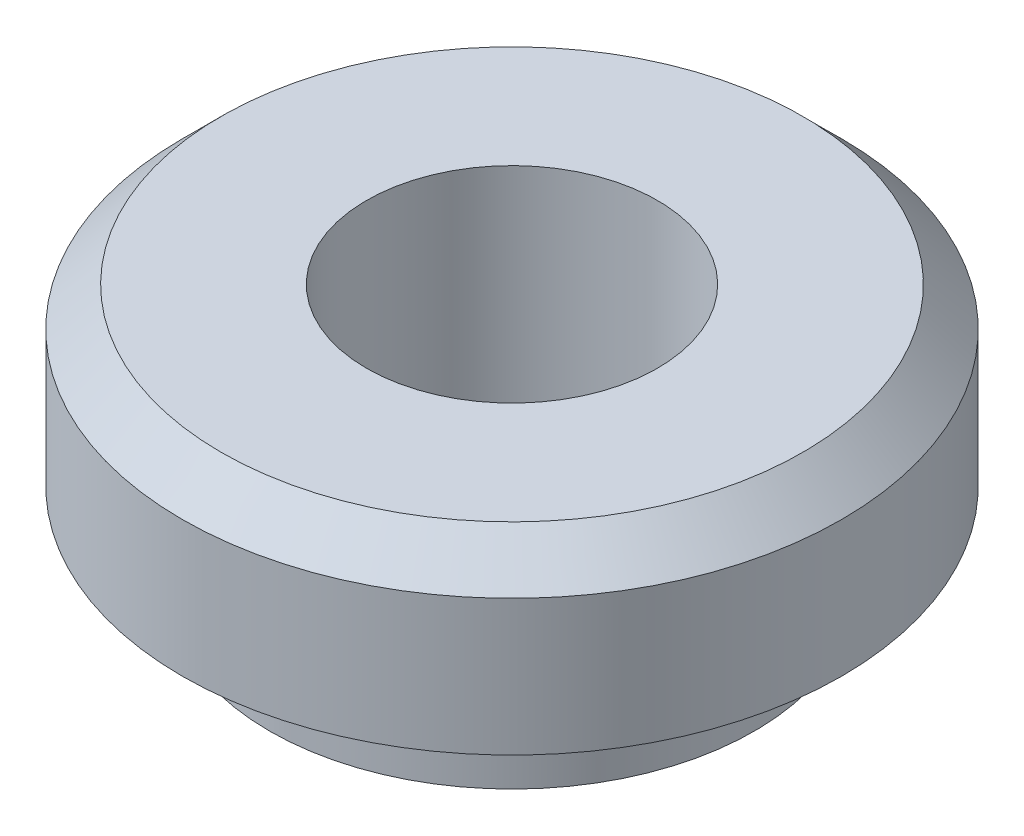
from build123d import *


with BuildPart() as part:
    # Sketch1 → Base-Revolve (revolve)
    with BuildSketch(Plane(origin=(0, 0, 0), x_dir=(0, 0, -1), z_dir=(1, 0, 0)), mode=Mode.PRIVATE) as base_revolve_sk:
        Polygon((1.905, -1.1938), (1.905, 2.286), (3.81, 2.286), (4.318, 1.778), (4.318, 0), (3.175, 0), (3.175, -1.1938), align=None)
    revolve(base_revolve_sk.sketch.rotate(Axis((0, 5.08, 0), (0, -1, 0)), 180), axis=Axis((0, 5.08, 0), (0, -1, 0)))


solid = part.part
